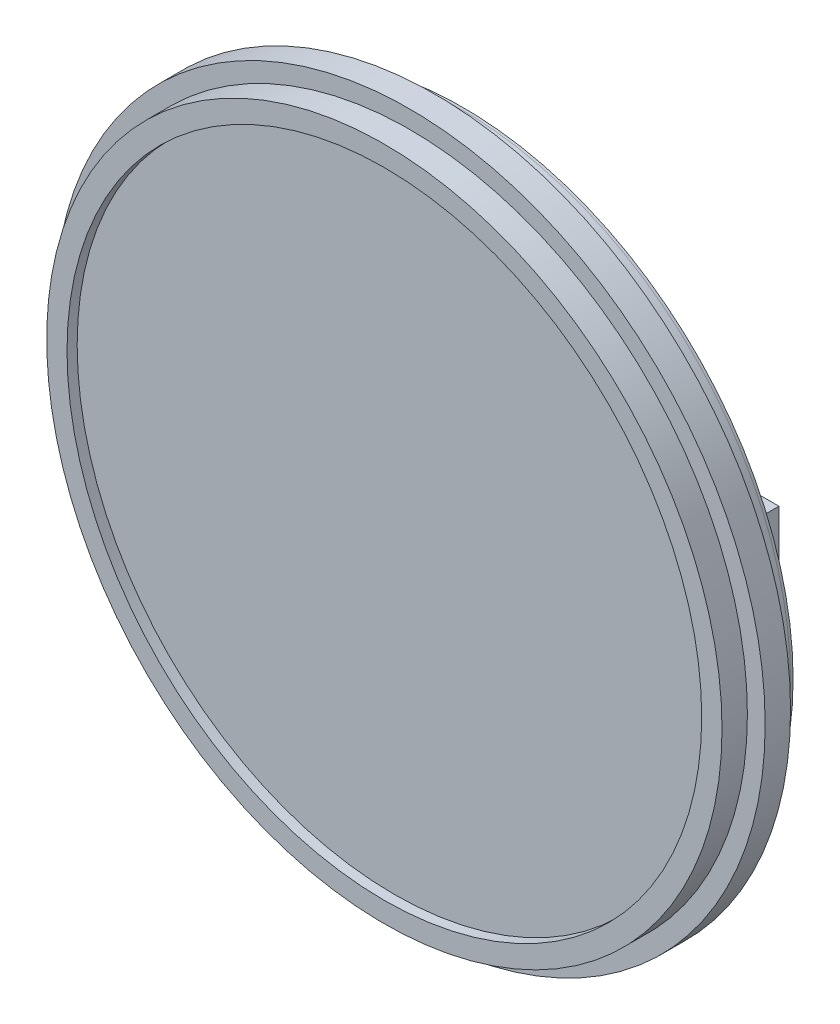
from build123d import *

# Parameters (mm, degrees)
SKETCH_1_R          = 14
EXTRUDE_1_DEPTH     = 1
SKETCH_2_R          = 13.3
EXTRUDE_2_DEPTH     = 1
SKETCH_3_R          = 12.5
CUT_EXTRUDE_2_DEPTH = 0.5
SKETCH_4_R          = 13
EXTRUDE_3_DEPTH     = 1
SKETCH_5_R          = 7.9
EXTRUDE_4_DEPTH     = 2
SKETCH_6_W          = 5.925942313
SKETCH_6_H          = 10.255153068
EXTRUDE_5_DEPTH     = 0.6
SKETCH_7_W          = 4.90352896
SKETCH_7_H          = 1.567823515
CUT_EXTRUDE_3_DEPTH = 0.6
SKETCH_8_R          = 12.5
EXTRUDE_6_DEPTH     = 0.1
SKETCH_9_R          = 13
EXTRUDE_7_DEPTH     = 0.1
EXTRUDE_9_DEPTH     = 0.1
EXTRUDE_9_2_DEPTH   = 0.1
EXTRUDE_9_3_DEPTH   = 0.1
EXTRUDE_9_4_DEPTH   = 0.1
EXTRUDE_9_5_DEPTH   = 0.1
EXTRUDE_9_6_DEPTH   = 0.1
EXTRUDE_9_7_DEPTH   = 0.1
EXTRUDE_9_8_DEPTH   = 0.1


with BuildPart() as part:
    # Sketch 1 → Extrude 1 (new body)
    with BuildSketch(Plane.XY):
        Circle(SKETCH_1_R)
    extrude(amount=EXTRUDE_1_DEPTH)

    # Sketch 4 → Extrude 3 (add)
    with BuildSketch(Plane(origin=(0, 0, 0), x_dir=(-1, 0, 0), z_dir=(0, 0, -1))):
        Circle(SKETCH_4_R)
    extrude(amount=EXTRUDE_3_DEPTH)

    # Sketch 5 → Extrude 4 (add)
    with BuildSketch(Plane(origin=(0, 0, -1), x_dir=(-1, 0, 0), z_dir=(0, 0, -1))):
        Circle(SKETCH_5_R)
    extrude(amount=EXTRUDE_4_DEPTH)


with BuildPart() as body_2:
    # Sketch 2 → Extrude 2 (new body)
    with BuildSketch(Plane.XY.offset(1)):
        Circle(SKETCH_2_R)
    extrude(amount=EXTRUDE_2_DEPTH)

    # Sketch 3 → Cut-Extrude 2 (cut)
    with BuildSketch(Plane.XY.offset(2)):
        Circle(SKETCH_3_R)
    extrude(amount=-CUT_EXTRUDE_2_DEPTH, mode=Mode.SUBTRACT)


with BuildPart() as body_3:
    # Sketch 6 → Extrude 5 (new body)
    with BuildSketch(Plane(origin=(0, 0, -1), x_dir=(-1, 0, 0), z_dir=(0, 0, -1))):
        with Locations((-8.979626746, -0.00802035)):
            Rectangle(SKETCH_6_W, SKETCH_6_H)
    extrude(amount=EXTRUDE_5_DEPTH)


with BuildPart() as cut_extrude_3_tool:
    # Sketch 7 → Cut-Extrude 3 (new body)
    with BuildSketch(Plane(origin=(0, 0, -1.6), x_dir=(-1, 0, 0), z_dir=(0, 0, -1))):
        with Locations((-9.490833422, -0.069704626)):
            Rectangle(SKETCH_7_W, SKETCH_7_H)
    extrude(amount=-CUT_EXTRUDE_3_DEPTH)


with BuildPart() as part_1:
    add(part.part)

    # Cut-Extrude 3: cut by cut_extrude_3_tool
    add(cut_extrude_3_tool.part, mode=Mode.SUBTRACT)


with BuildPart() as body_3_1:
    add(body_3.part)

    # Cut-Extrude 3: cut by cut_extrude_3_tool
    add(cut_extrude_3_tool.part, mode=Mode.SUBTRACT)


with BuildPart() as body_4:
    # Sketch 8 → Extrude 6 (new body)
    with BuildSketch(Plane.XY.offset(1.5)):
        Circle(SKETCH_8_R)
    extrude(amount=EXTRUDE_6_DEPTH)


with BuildPart() as body_5:
    # Sketch 9 → Extrude 7 (new body)
    with BuildSketch(Plane(origin=(0, 0, -1), x_dir=(-1, 0, 0), z_dir=(0, 0, -1))):
        Circle(SKETCH_9_R)
    extrude(amount=EXTRUDE_7_DEPTH)


with BuildPart() as body_6:
    # Sketch 10 → Extrude 9 (new body)
    with BuildSketch(Plane(origin=(0, 0, -3), x_dir=(-1, 0, 0), z_dir=(0, 0, -1))):
        with BuildLine():
            add(Edge.make_bspline(
                [(-4.168273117, 2.779709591), (-4.14661618, 2.768417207), (-4.104377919, 2.746393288), (-4.044221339, 2.710930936), (-3.989244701, 2.673555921), (-3.937922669, 2.636033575), (-3.891156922, 2.59692691), (-3.849470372, 2.556080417), (-3.811833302, 2.514513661), (-3.779004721, 2.47152277), (-3.750129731, 2.427221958), (-3.725174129, 2.381494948), (-3.703843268, 2.334441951), (-3.686937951, 2.285549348), (-3.673011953, 2.23553534), (-3.6634298, 2.183754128), (-3.658276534, 2.130546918), (-3.657302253, 2.094587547), (-3.656808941, 2.076380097)],
                knots=[0, 0, 0, 0, 1.272397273, 2.481599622, 3.635517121, 4.734568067, 5.792894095, 6.808321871, 7.773003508, 8.711915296, 9.623354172, 10.525449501, 11.423591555, 12.311487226, 13.218079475, 14.126165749, 15.051214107, 16, 16, 16, 16], degree=3))
            add(Edge.make_bspline(
                [(-3.656808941, 2.076380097), (-3.657392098, 2.050906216), (-3.658546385, 2.000483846), (-3.66860054, 1.926063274), (-3.683653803, 1.85378532), (-3.70563653, 1.78366583), (-3.734146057, 1.71609172), (-3.769280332, 1.651005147), (-3.809051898, 1.58733936), (-3.840992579, 1.54816636), (-3.857154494, 1.528344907)],
                knots=[0, 0, 0, 0, 1.025265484, 2.029385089, 3.018602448, 3.995076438, 4.983346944, 5.966715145, 6.97116228, 8, 8, 8, 8], degree=3))
            add(Edge.make_bspline(
                [(-3.857154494, 1.528344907), (-3.878197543, 1.505217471), (-3.920023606, 1.45924839), (-3.991674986, 1.399565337), (-4.070310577, 1.349408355), (-4.155626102, 1.308532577), (-4.247393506, 1.276717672), (-4.345593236, 1.253855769), (-4.450416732, 1.240760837), (-4.52246313, 1.23886794), (-4.559423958, 1.237896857)],
                knots=[0, 0, 0, 0, 0.954267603, 1.896743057, 2.838368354, 3.796610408, 4.779680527, 5.799409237, 6.871065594, 8, 8, 8, 8], degree=3))
            add(Edge.make_bspline(
                [(-4.559423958, 1.237896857), (-4.594963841, 1.238768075), (-4.664120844, 1.240463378), (-4.764781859, 1.251949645), (-4.858612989, 1.272079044), (-4.94615981, 1.299629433), (-5.026894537, 1.335469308), (-5.100587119, 1.380076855), (-5.168300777, 1.431656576), (-5.227980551, 1.491689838), (-5.280964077, 1.555989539), (-5.327506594, 1.622325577), (-5.36619176, 1.690704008), (-5.398944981, 1.76010525), (-5.424018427, 1.831502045), (-5.441384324, 1.904527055), (-5.45241315, 1.979052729), (-5.453880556, 2.02934749), (-5.45461877, 2.054649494)],
                knots=[0, 0, 0, 0, 1.256902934, 2.445805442, 3.576955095, 4.645999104, 5.686449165, 6.692658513, 7.68621702, 8.689161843, 9.678783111, 10.630372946, 11.551080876, 12.453998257, 13.34127905, 14.221779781, 15.105423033, 16, 16, 16, 16], degree=3))
            add(Edge.make_bspline(
                [(-5.45461877, 2.054649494), (-5.45418192, 2.073215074), (-5.453318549, 2.109907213), (-5.44734286, 2.16411605), (-5.437735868, 2.216878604), (-5.424688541, 2.268389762), (-5.407006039, 2.318274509), (-5.385656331, 2.366769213), (-5.360761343, 2.413928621), (-5.331973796, 2.460010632), (-5.298483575, 2.504369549), (-5.260562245, 2.547758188), (-5.217451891, 2.58950329), (-5.169632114, 2.630114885), (-5.117649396, 2.670313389), (-5.060153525, 2.70792635), (-4.998668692, 2.745616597), (-4.954970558, 2.768150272), (-4.9325543, 2.779709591)],
                knots=[0, 0, 0, 0, 0.941657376, 1.861047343, 2.762797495, 3.66048619, 4.553285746, 5.444104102, 6.34607688, 7.256116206, 8.197091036, 9.162375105, 10.176350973, 11.237807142, 12.343728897, 13.50695164, 14.721116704, 16, 16, 16, 16], degree=3))
            add(Edge.make_bspline(
                [(-4.9325543, 2.779709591), (-4.963239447, 2.796442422), (-5.022654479, 2.828841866), (-5.10132602, 2.888370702), (-5.168901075, 2.952844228), (-5.223522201, 3.023623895), (-5.266514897, 3.098498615), (-5.296011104, 3.176999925), (-5.315965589, 3.257672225), (-5.317942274, 3.312785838), (-5.318935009, 3.340465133)],
                knots=[0, 0, 0, 0, 1.166880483, 2.259407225, 3.286803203, 4.280235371, 5.237608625, 6.161067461, 7.076446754, 8, 8, 8, 8], degree=3))
            add(Edge.make_bspline(
                [(-5.318935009, 3.340465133), (-5.317698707, 3.368660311), (-5.315213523, 3.425337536), (-5.295117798, 3.509706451), (-5.262369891, 3.592571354), (-5.217828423, 3.673530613), (-5.162351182, 3.749844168), (-5.095792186, 3.818288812), (-5.019740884, 3.878244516), (-4.934576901, 3.928572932), (-4.84292808, 3.969533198), (-4.746229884, 3.997789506), (-4.646167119, 4.016262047), (-4.578057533, 4.018353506), (-4.543523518, 4.019413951)],
                knots=[0, 0, 0, 0, 0.888701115, 1.786444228, 2.72001202, 3.692817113, 4.693886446, 5.687152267, 6.695133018, 7.739871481, 8.800368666, 9.853104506, 10.91144658, 12, 12, 12, 12], degree=3))
            add(Edge.make_bspline(
                [(-4.543523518, 4.019413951), (-4.509880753, 4.018320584), (-4.443541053, 4.01616459), (-4.346027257, 3.998182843), (-4.252723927, 3.968149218), (-4.163952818, 3.927405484), (-4.081303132, 3.877220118), (-4.008276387, 3.816440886), (-3.943769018, 3.748298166), (-3.890410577, 3.672007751), (-3.846442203, 3.591359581), (-3.81582545, 3.506978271), (-3.796206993, 3.420687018), (-3.793732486, 3.362298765), (-3.792492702, 3.333044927)],
                knots=[0, 0, 0, 0, 1.072916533, 2.115669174, 3.151510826, 4.193348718, 5.225979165, 6.227137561, 7.216255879, 8.211077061, 9.189680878, 10.138522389, 11.067357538, 12, 12, 12, 12], degree=3))
            add(Edge.make_bspline(
                [(-3.792492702, 3.333044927), (-3.793577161, 3.304336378), (-3.795706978, 3.247954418), (-3.813623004, 3.165762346), (-3.843795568, 3.088789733), (-3.88499056, 3.016163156), (-3.938682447, 2.949199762), (-4.004154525, 2.887048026), (-4.080884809, 2.829197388), (-4.138534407, 2.796550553), (-4.168273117, 2.779709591)],
                knots=[0, 0, 0, 0, 0.975232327, 1.915300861, 2.843280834, 3.77672583, 4.742871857, 5.749627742, 6.839139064, 8, 8, 8, 8], degree=3))
        make_face()
        with BuildLine():
            add(Edge.make_bspline(
                [(-4.556773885, 3.74804643), (-4.575333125, 3.747553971), (-4.611643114, 3.746590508), (-4.664883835, 3.741556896), (-4.715511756, 3.731764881), (-4.764055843, 3.718733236), (-4.809850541, 3.701128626), (-4.853517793, 3.680419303), (-4.894314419, 3.655241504), (-4.932732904, 3.626998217), (-4.967318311, 3.595933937), (-4.998013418, 3.563568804), (-5.023510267, 3.529267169), (-5.045161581, 3.493882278), (-5.060871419, 3.456363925), (-5.072637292, 3.417862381), (-5.080590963, 3.377891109), (-5.081186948, 3.350573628), (-5.081488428, 3.33675503)],
                knots=[0, 0, 0, 0, 1.203892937, 2.355340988, 3.463153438, 4.544400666, 5.610487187, 6.640501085, 7.674077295, 8.714426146, 9.728707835, 10.68524104, 11.601827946, 12.495867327, 13.368432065, 14.231010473, 15.105153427, 16, 16, 16, 16], degree=3))
            add(Edge.make_bspline(
                [(-5.081488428, 3.33675503), (-5.080968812, 3.322935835), (-5.079941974, 3.295627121), (-5.072000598, 3.255300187), (-5.060164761, 3.215671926), (-5.041530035, 3.17768463), (-5.019179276, 3.140020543), (-4.991593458, 3.103620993), (-4.958717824, 3.068359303), (-4.921655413, 3.034535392), (-4.881278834, 3.002861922), (-4.838503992, 2.975365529), (-4.793867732, 2.952358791), (-4.747828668, 2.933210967), (-4.699917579, 2.918326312), (-4.650428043, 2.907766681), (-4.599351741, 2.901203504), (-4.564743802, 2.900419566), (-4.54723362, 2.900022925)],
                knots=[0, 0, 0, 0, 0.873023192, 1.725219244, 2.590779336, 3.480155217, 4.391973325, 5.357036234, 6.360879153, 7.436073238, 8.526419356, 9.601555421, 10.645666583, 11.697338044, 12.750135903, 13.812665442, 14.89329948, 16, 16, 16, 16], degree=3))
            add(Edge.make_bspline(
                [(-4.54723362, 2.900022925), (-4.524743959, 2.900682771), (-4.479986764, 2.901995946), (-4.414007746, 2.914205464), (-4.349855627, 2.933411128), (-4.288216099, 2.959688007), (-4.230684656, 2.992668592), (-4.179400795, 3.032154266), (-4.134801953, 3.077233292), (-4.097351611, 3.127203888), (-4.068315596, 3.180386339), (-4.045711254, 3.233756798), (-4.032511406, 3.287884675), (-4.030789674, 3.324145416), (-4.029939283, 3.342055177)],
                knots=[0, 0, 0, 0, 1.076279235, 2.141928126, 3.20205304, 4.278698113, 5.344010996, 6.36967002, 7.368914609, 8.37248503, 9.349703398, 10.264243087, 11.142681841, 12, 12, 12, 12], degree=3))
            add(Edge.make_bspline(
                [(-4.029939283, 3.342055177), (-4.030341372, 3.35462518), (-4.031139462, 3.379574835), (-4.03771629, 3.416418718), (-4.048583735, 3.452424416), (-4.063296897, 3.48788937), (-4.082656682, 3.522315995), (-4.105610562, 3.556245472), (-4.133493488, 3.588914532), (-4.164787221, 3.6210845), (-4.200275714, 3.650856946), (-4.239890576, 3.677039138), (-4.283428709, 3.699273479), (-4.330891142, 3.71733224), (-4.382103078, 3.730895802), (-4.436828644, 3.741053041), (-4.495524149, 3.746777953), (-4.535914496, 3.747614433), (-4.556773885, 3.74804643)],
                knots=[0, 0, 0, 0, 0.814439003, 1.616544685, 2.417341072, 3.248991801, 4.09997495, 4.973547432, 5.9003056, 6.880240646, 7.880314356, 8.896779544, 9.951930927, 11.043077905, 12.18215768, 13.381699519, 14.647792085, 16, 16, 16, 16], degree=3))
        make_face(mode=Mode.SUBTRACT)
        with BuildLine():
            add(Edge.make_bspline(
                [(-4.541403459, 2.628655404), (-4.564933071, 2.628236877), (-4.611092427, 2.62741583), (-4.678717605, 2.618276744), (-4.74361851, 2.605554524), (-4.805576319, 2.586254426), (-4.864564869, 2.56115946), (-4.920903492, 2.53097085), (-4.974161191, 2.495285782), (-5.023602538, 2.454557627), (-5.068750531, 2.410667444), (-5.10836115, 2.364204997), (-5.141999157, 2.316033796), (-5.169087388, 2.265542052), (-5.191321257, 2.213798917), (-5.205921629, 2.159515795), (-5.215281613, 2.103736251), (-5.216538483, 2.065817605), (-5.217172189, 2.046699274)],
                knots=[0, 0, 0, 0, 1.140299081, 2.23698856, 3.303958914, 4.344563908, 5.37730929, 6.408454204, 7.439741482, 8.480804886, 9.510774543, 10.48932336, 11.43758569, 12.353841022, 13.263987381, 14.161954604, 15.073269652, 16, 16, 16, 16], degree=3))
            add(Edge.make_bspline(
                [(-5.217172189, 2.046699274), (-5.21614163, 2.022939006), (-5.214097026, 1.975799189), (-5.197876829, 1.906128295), (-5.171845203, 1.838681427), (-5.135540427, 1.774008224), (-5.090585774, 1.713569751), (-5.035305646, 1.660888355), (-4.973135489, 1.614078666), (-4.901971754, 1.576220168), (-4.824238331, 1.545985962), (-4.739955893, 1.525154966), (-4.65033402, 1.511365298), (-4.588452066, 1.509975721), (-4.556773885, 1.509264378)],
                knots=[0, 0, 0, 0, 0.898778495, 1.783155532, 2.693654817, 3.627872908, 4.583023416, 5.533784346, 6.509005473, 7.520592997, 8.575161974, 9.658835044, 10.801527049, 12, 12, 12, 12], degree=3))
            add(Edge.make_bspline(
                [(-4.556773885, 1.509264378), (-4.532016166, 1.509739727), (-4.483780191, 1.51066586), (-4.413411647, 1.518840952), (-4.347005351, 1.531805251), (-4.284690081, 1.550661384), (-4.225768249, 1.573680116), (-4.171238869, 1.603292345), (-4.119699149, 1.636971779), (-4.07368877, 1.676930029), (-4.031783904, 1.719625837), (-3.995246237, 1.764824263), (-3.963528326, 1.811296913), (-3.938634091, 1.860094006), (-3.918732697, 1.910279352), (-3.904427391, 1.962315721), (-3.895600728, 2.016362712), (-3.894708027, 2.053025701), (-3.894255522, 2.071609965)],
                knots=[0, 0, 0, 0, 1.224942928, 2.386581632, 3.501229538, 4.569074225, 5.605009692, 6.626002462, 7.634866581, 8.645888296, 9.63523824, 10.59253846, 11.518950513, 12.414518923, 13.29783783, 14.186679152, 15.080837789, 16, 16, 16, 16], degree=3))
            add(Edge.make_bspline(
                [(-3.894255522, 2.071609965), (-3.894940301, 2.089660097), (-3.896290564, 2.125251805), (-3.904860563, 2.177991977), (-3.919916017, 2.228945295), (-3.940574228, 2.278724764), (-3.968076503, 2.326321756), (-4.000465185, 2.372976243), (-4.039543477, 2.417393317), (-4.083700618, 2.459917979), (-4.131823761, 2.499239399), (-4.1829769, 2.534024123), (-4.236766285, 2.563318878), (-4.293078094, 2.587143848), (-4.351787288, 2.605881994), (-4.412850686, 2.618972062), (-4.476339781, 2.627211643), (-4.519470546, 2.628168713), (-4.541403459, 2.628655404)],
                knots=[0, 0, 0, 0, 0.917430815, 1.809013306, 2.70690318, 3.612392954, 4.541220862, 5.495268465, 6.494511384, 7.542276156, 8.608045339, 9.649016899, 10.681629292, 11.715607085, 12.752076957, 13.808767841, 14.885711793, 16, 16, 16, 16], degree=3))
        make_face(mode=Mode.SUBTRACT)
    extrude(amount=EXTRUDE_9_DEPTH)


with BuildPart() as body_7:
    # Sketch 10 → Extrude 9 2 (new body)
    with BuildSketch(Plane(origin=(0, 0, -3), x_dir=(-1, 0, 0), z_dir=(0, 0, -1))):
        with BuildLine():
            Line((-1.57067112, 1.543185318), (-0.739608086, 1.543185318))
            Line((-0.739608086, 1.543185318), (-0.739608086, 1.305738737))
            Line((-0.739608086, 1.305738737), (-1.799637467, 1.305738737))
            Line((-1.799637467, 1.305738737), (-1.799637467, 1.638587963))
            add(Edge.make_bspline(
                [(-1.799637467, 1.638587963), (-1.753212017, 1.667164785), (-1.664097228, 1.722018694), (-1.538130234, 1.804409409), (-1.42617257, 1.884526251), (-1.327285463, 1.961188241), (-1.241627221, 2.034748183), (-1.168948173, 2.105157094), (-1.1096607, 2.172611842), (-1.063391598, 2.23840586), (-1.026990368, 2.303057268), (-0.99564101, 2.36712496), (-0.968934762, 2.43205634), (-0.947235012, 2.497787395), (-0.930162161, 2.564356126), (-0.917849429, 2.631631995), (-0.911002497, 2.699888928), (-0.909811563, 2.745597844), (-0.909212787, 2.768579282)],
                knots=[0, 0, 0, 0, 1.726964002, 3.314949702, 4.76710701, 6.087048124, 7.277484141, 8.342115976, 9.29034651, 10.117945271, 10.885025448, 11.63844732, 12.376368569, 13.107316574, 13.829469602, 14.551817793, 15.271885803, 16, 16, 16, 16], degree=3))
            add(Edge.make_bspline(
                [(-0.909212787, 2.768579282), (-0.910149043, 2.80501337), (-0.911978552, 2.876208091), (-0.925678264, 2.980203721), (-0.949795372, 3.078316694), (-0.982632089, 3.170926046), (-1.024523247, 3.258220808), (-1.077011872, 3.33899492), (-1.138455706, 3.414394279), (-1.208896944, 3.483411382), (-1.28656499, 3.545867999), (-1.370746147, 3.60027566), (-1.46083765, 3.645674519), (-1.556189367, 3.684023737), (-1.657911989, 3.711831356), (-1.764590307, 3.733528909), (-1.877273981, 3.745566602), (-1.954198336, 3.747206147), (-1.993622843, 3.74804643)],
                knots=[0, 0, 0, 0, 1.062437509, 2.076076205, 3.052086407, 4.003844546, 4.937153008, 5.869009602, 6.806518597, 7.768404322, 8.739669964, 9.708677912, 10.685721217, 11.677931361, 12.700644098, 13.756614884, 14.850242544, 16, 16, 16, 16], degree=3))
            add(Edge.make_bspline(
                [(-1.993622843, 3.74804643), (-2.033048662, 3.747204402), (-2.110151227, 3.745557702), (-2.22299046, 3.733503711), (-2.329996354, 3.712082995), (-2.431471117, 3.683025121), (-2.527629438, 3.646109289), (-2.617405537, 3.599588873), (-2.701813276, 3.545230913), (-2.779881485, 3.48303287), (-2.850545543, 3.41381967), (-2.911690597, 3.337994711), (-2.964251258, 3.257046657), (-3.006671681, 3.170128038), (-3.039846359, 3.077717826), (-3.062792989, 2.979537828), (-3.077600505, 2.875915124), (-3.079290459, 2.804849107), (-3.080152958, 2.768579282)],
                knots=[0, 0, 0, 0, 1.14892738, 2.246884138, 3.302092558, 4.325479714, 5.319883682, 6.298567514, 7.266875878, 8.241460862, 9.202652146, 10.143479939, 11.074663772, 12.009555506, 12.955777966, 13.929873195, 14.943473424, 16, 16, 16, 16], degree=3))
            add(Edge.make_bspline(
                [(-3.080152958, 2.768579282), (-3.079786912, 2.745771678), (-3.079058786, 2.70040359), (-3.071909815, 2.632733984), (-3.060152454, 2.566039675), (-3.044429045, 2.500058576), (-3.023373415, 2.435242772), (-2.998697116, 2.370971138), (-2.96872323, 2.307861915), (-2.933870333, 2.24403199), (-2.888907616, 2.179011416), (-2.830122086, 2.112416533), (-2.758146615, 2.041626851), (-2.671375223, 1.968192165), (-2.571398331, 1.889843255), (-2.456858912, 1.808767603), (-2.328407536, 1.723939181), (-2.237241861, 1.667830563), (-2.189728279, 1.638587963)],
                knots=[0, 0, 0, 0, 0.721480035, 1.435142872, 2.150161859, 2.863342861, 3.579344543, 4.304992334, 5.040202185, 5.788409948, 6.604059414, 7.535407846, 8.59480259, 9.795963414, 11.130050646, 12.612998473, 14.2347679, 16, 16, 16, 16], degree=3))
            Line((-2.189728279, 1.638587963), (-2.189728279, 1.305738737))
            Line((-2.189728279, 1.305738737), (-3.249757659, 1.305738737))
            Line((-3.249757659, 1.305738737), (-3.249757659, 1.543185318))
            Line((-3.249757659, 1.543185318), (-2.418694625, 1.543185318))
            add(Edge.make_bspline(
                [(-2.418694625, 1.543185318), (-2.462349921, 1.569908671), (-2.54683868, 1.621628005), (-2.665908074, 1.701443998), (-2.773316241, 1.780082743), (-2.869687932, 1.856792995), (-2.954574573, 1.932402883), (-3.028302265, 2.006566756), (-3.090174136, 2.079661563), (-3.140985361, 2.152430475), (-3.182467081, 2.225684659), (-3.218757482, 2.299590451), (-3.249784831, 2.375223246), (-3.273817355, 2.453274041), (-3.293898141, 2.532775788), (-3.307254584, 2.614526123), (-3.316261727, 2.697885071), (-3.317151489, 2.754068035), (-3.317599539, 2.782359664)],
                knots=[0, 0, 0, 0, 1.521507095, 2.944665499, 4.259859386, 5.477903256, 6.604940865, 7.637391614, 8.584217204, 9.448190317, 10.271606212, 11.084316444, 11.894783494, 12.698740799, 13.510160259, 14.330421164, 15.159262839, 16, 16, 16, 16], degree=3))
            add(Edge.make_bspline(
                [(-3.317599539, 2.782359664), (-3.316526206, 2.827293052), (-3.31442175, 2.915392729), (-3.296548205, 3.044117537), (-3.267514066, 3.166345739), (-3.2265163, 3.282048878), (-3.173926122, 3.391296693), (-3.109197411, 3.493744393), (-3.032909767, 3.589658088), (-2.945579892, 3.678123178), (-2.849691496, 3.758651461), (-2.745788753, 3.828069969), (-2.636023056, 3.887386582), (-2.519864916, 3.93571934), (-2.397223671, 3.973474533), (-2.268247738, 4.000322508), (-2.132900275, 4.016502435), (-2.040662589, 4.018430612), (-1.993622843, 4.019413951)],
                knots=[0, 0, 0, 0, 1.060031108, 2.07837429, 3.060328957, 4.020369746, 4.969556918, 5.915799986, 6.874309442, 7.856113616, 8.844790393, 9.824263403, 10.799921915, 11.784872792, 12.788496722, 13.823745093, 14.890144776, 16, 16, 16, 16], degree=3))
            add(Edge.make_bspline(
                [(-1.993622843, 4.019413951), (-1.946584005, 4.018426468), (-1.854348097, 4.016490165), (-1.719159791, 4.000389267), (-1.590395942, 3.97338687), (-1.4678996, 3.935741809), (-1.351787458, 3.88733352), (-1.242118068, 3.828397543), (-1.139039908, 3.758286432), (-1.043213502, 3.678176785), (-0.955973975, 3.589620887), (-0.879550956, 3.493911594), (-0.815535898, 3.391125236), (-0.762812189, 3.282072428), (-0.721861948, 3.166339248), (-0.692814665, 3.044119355), (-0.67494476, 2.915392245), (-0.672839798, 2.827292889), (-0.671766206, 2.782359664)],
                knots=[0, 0, 0, 0, 1.110772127, 2.178052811, 3.210072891, 4.214525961, 5.200290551, 6.176755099, 7.150120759, 8.139614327, 9.122229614, 10.081530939, 11.026337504, 11.976308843, 12.937142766, 13.91990867, 14.939093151, 16, 16, 16, 16], degree=3))
            add(Edge.make_bspline(
                [(-0.671766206, 2.782359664), (-0.672219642, 2.754069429), (-0.673120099, 2.697889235), (-0.682048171, 2.61450981), (-0.695693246, 2.532877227), (-0.714685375, 2.45308157), (-0.739788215, 2.375341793), (-0.770546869, 2.299571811), (-0.806915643, 2.225690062), (-0.848374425, 2.152427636), (-0.899198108, 2.079667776), (-0.961041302, 2.006541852), (-1.034790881, 1.932601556), (-1.119189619, 1.8564267), (-1.216051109, 1.780301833), (-1.323423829, 1.70140281), (-1.442536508, 1.621639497), (-1.527019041, 1.569912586), (-1.57067112, 1.543185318)],
                knots=[0, 0, 0, 0, 0.840708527, 1.669521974, 2.489754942, 3.299905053, 4.10542877, 4.915868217, 5.728550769, 6.551938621, 7.415882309, 8.362675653, 9.395091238, 10.51818009, 11.740285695, 13.055434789, 14.478544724, 16, 16, 16, 16], degree=3))
        make_face()
    extrude(amount=EXTRUDE_9_2_DEPTH)


with BuildPart() as body_8:
    # Sketch 10 → Extrude 9 3 (new body)
    with BuildSketch(Plane(origin=(0, 0, -3), x_dir=(-1, 0, 0), z_dir=(0, 0, -1))):
        Polygon((1.213496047, 3.951572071), (1.702699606, 3.951572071), (1.702699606, 1.305738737), (1.465253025, 1.305738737), (1.465253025, 3.680204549), (1.058201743, 3.680204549), align=None)
    extrude(amount=EXTRUDE_9_3_DEPTH)


with BuildPart() as body_9:
    # Sketch 10 → Extrude 9 4 (new body)
    with BuildSketch(Plane(origin=(0, 0, -3), x_dir=(-1, 0, 0), z_dir=(0, 0, -1))):
        Polygon((2.754248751, 3.951572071), (2.999645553, 3.951572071), (3.517469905, 2.01118829), (4.28758125, 3.951572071), (4.322032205, 3.951572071), (5.077833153, 2.024438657), (5.598307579, 3.951572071), (5.841054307, 3.951572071), (5.127654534, 1.305738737), (5.093733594, 1.305738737), (4.297651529, 3.329334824), (3.4920292, 1.305738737), (3.45810826, 1.305738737), align=None)
    extrude(amount=EXTRUDE_9_4_DEPTH)


with BuildPart() as body_10:
    # Sketch 10 → Extrude 9 5 (new body)
    with BuildSketch(Plane(origin=(0, 0, -3), x_dir=(-1, 0, 0), z_dir=(0, 0, -1))):
        with BuildLine():
            Line((-5.115409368, -2.272252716), (-5.35285595, -2.272252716))
            add(Edge.make_bspline(
                [(-5.35285595, -2.272252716), (-5.351308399, -2.240751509), (-5.348269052, -2.178883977), (-5.334035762, -2.088680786), (-5.313669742, -2.002460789), (-5.284874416, -1.920916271), (-5.249113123, -1.84332622), (-5.206227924, -1.769998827), (-5.155432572, -1.701213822), (-5.09782391, -1.637608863), (-5.035254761, -1.579258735), (-4.967743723, -1.528870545), (-4.896801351, -1.486297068), (-4.822642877, -1.450705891), (-4.744431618, -1.42399065), (-4.662877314, -1.404168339), (-4.577621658, -1.392242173), (-4.51953426, -1.39096024), (-4.489992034, -1.390308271)],
                knots=[0, 0, 0, 0, 1.10065271, 2.161652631, 3.183658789, 4.190468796, 5.17591951, 6.163126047, 7.15150782, 8.156236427, 9.156009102, 10.134482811, 11.092018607, 12.041330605, 13.001268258, 13.972401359, 14.968799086, 16, 16, 16, 16], degree=3))
            add(Edge.make_bspline(
                [(-4.489992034, -1.390308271), (-4.460980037, -1.390987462), (-4.403972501, -1.392322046), (-4.320770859, -1.403783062), (-4.241564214, -1.421733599), (-4.16650739, -1.446918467), (-4.096199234, -1.480773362), (-4.030111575, -1.521441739), (-3.967457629, -1.568476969), (-3.911058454, -1.623853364), (-3.859269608, -1.682970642), (-3.814591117, -1.746083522), (-3.776329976, -1.811268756), (-3.744438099, -1.879023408), (-3.720961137, -1.949985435), (-3.703137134, -2.023121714), (-3.693062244, -2.099189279), (-3.691516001, -2.150674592), (-3.690729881, -2.176850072)],
                knots=[0, 0, 0, 0, 1.111607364, 2.184268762, 3.212621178, 4.221274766, 5.211760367, 6.196651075, 7.1921475, 8.207485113, 9.220403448, 10.201281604, 11.166441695, 12.114753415, 13.065576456, 14.026450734, 14.996634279, 16, 16, 16, 16], degree=3))
            add(Edge.make_bspline(
                [(-3.690729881, -2.176850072), (-3.692009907, -2.213701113), (-3.694547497, -2.286756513), (-3.716254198, -2.394112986), (-3.750156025, -2.498127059), (-3.790975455, -2.581839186), (-3.832154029, -2.649295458), (-3.869261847, -2.704834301), (-3.912702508, -2.764634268), (-3.963108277, -2.828495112), (-4.019436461, -2.896917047), (-4.082197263, -2.969858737), (-4.151838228, -3.046566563), (-4.200716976, -3.098958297), (-4.226044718, -3.126106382)],
                knots=[0, 0, 0, 0, 1.184426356, 2.348067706, 3.509069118, 4.696110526, 5.333549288, 6.050745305, 6.844228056, 7.710549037, 8.667450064, 9.695053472, 10.805634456, 12, 12, 12, 12], degree=3))
            Line((-4.226044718, -3.126106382), (-4.888033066, -3.832615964))
            Line((-4.888033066, -3.832615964), (-3.656808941, -3.832615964))
            Line((-3.656808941, -3.832615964), (-3.656808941, -4.103983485))
            Line((-3.656808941, -4.103983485), (-5.45461877, -4.103983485))
            Line((-5.45461877, -4.103983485), (-4.42851033, -3.008973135))
            add(Edge.make_bspline(
                [(-4.42851033, -3.008973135), (-4.403527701, -2.982894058), (-4.355541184, -2.932801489), (-4.287669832, -2.859668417), (-4.226710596, -2.791822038), (-4.172268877, -2.72939054), (-4.125525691, -2.671460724), (-4.084044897, -2.619908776), (-4.050809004, -2.5724694), (-4.014738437, -2.517480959), (-3.979802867, -2.450343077), (-3.949782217, -2.368296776), (-3.931476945, -2.283836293), (-3.929281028, -2.226760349), (-3.928176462, -2.198050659)],
                knots=[0, 0, 0, 0, 1.329631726, 2.553950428, 3.673215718, 4.687767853, 5.603093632, 6.413772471, 7.123043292, 7.734684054, 8.834405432, 9.900288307, 10.943827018, 12, 12, 12, 12], degree=3))
            add(Edge.make_bspline(
                [(-3.928176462, -2.198050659), (-3.928657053, -2.179997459), (-3.929604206, -2.144418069), (-3.937963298, -2.092253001), (-3.950595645, -2.041933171), (-3.96869712, -1.993303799), (-3.992590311, -1.946853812), (-4.021674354, -1.902526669), (-4.055231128, -1.859672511), (-4.094050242, -1.819491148), (-4.136694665, -1.782690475), (-4.18174508, -1.75009072), (-4.229407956, -1.722846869), (-4.279482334, -1.700513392), (-4.331828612, -1.682993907), (-4.386548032, -1.670854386), (-4.443489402, -1.663232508), (-4.482370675, -1.662201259), (-4.502182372, -1.661675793)],
                knots=[0, 0, 0, 0, 0.991446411, 1.95395049, 2.89581595, 3.838931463, 4.798493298, 5.75982156, 6.748411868, 7.785213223, 8.824556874, 9.840280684, 10.836137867, 11.835679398, 12.848801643, 13.863922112, 14.911575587, 16, 16, 16, 16], degree=3))
            add(Edge.make_bspline(
                [(-4.502182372, -1.661675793), (-4.522873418, -1.662216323), (-4.563507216, -1.663277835), (-4.623166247, -1.670703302), (-4.68007871, -1.68351355), (-4.734387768, -1.701034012), (-4.786185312, -1.723303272), (-4.83521944, -1.751040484), (-4.881380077, -1.78413872), (-4.924753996, -1.821664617), (-4.964716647, -1.863444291), (-4.999828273, -1.91001849), (-5.030507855, -1.960536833), (-5.05727555, -2.014863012), (-5.079013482, -2.073489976), (-5.095624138, -2.13620961), (-5.108767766, -2.202749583), (-5.113158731, -2.248700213), (-5.115409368, -2.272252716)],
                knots=[0, 0, 0, 0, 1.031018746, 2.02475058, 2.990194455, 3.934040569, 4.864654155, 5.795059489, 6.735614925, 7.690564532, 8.649604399, 9.611025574, 10.590972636, 11.591080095, 12.624614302, 13.701020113, 14.821632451, 16, 16, 16, 16], degree=3))
        make_face()
    extrude(amount=EXTRUDE_9_5_DEPTH)


with BuildPart() as body_11:
    # Sketch 10 → Extrude 9 6 (new body)
    with BuildSketch(Plane(origin=(0, 0, -3), x_dir=(-1, 0, 0), z_dir=(0, 0, -1))):
        with BuildLine():
            add(Edge.make_bspline(
                [(-2.133016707, -2.630012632), (-2.111359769, -2.641305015), (-2.069121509, -2.663328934), (-2.008964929, -2.698791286), (-1.953988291, -2.736166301), (-1.902666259, -2.773688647), (-1.855900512, -2.812795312), (-1.814213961, -2.853641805), (-1.776576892, -2.895208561), (-1.743748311, -2.938199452), (-1.714873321, -2.982500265), (-1.689917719, -3.028227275), (-1.668586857, -3.075280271), (-1.651681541, -3.124172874), (-1.637755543, -3.174186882), (-1.628173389, -3.225968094), (-1.623020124, -3.279175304), (-1.622045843, -3.315134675), (-1.621552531, -3.333342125)],
                knots=[0, 0, 0, 0, 1.272397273, 2.481599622, 3.635517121, 4.734568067, 5.792894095, 6.808321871, 7.773003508, 8.711915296, 9.623354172, 10.525449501, 11.423591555, 12.311487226, 13.218079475, 14.126165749, 15.051214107, 16, 16, 16, 16], degree=3))
            add(Edge.make_bspline(
                [(-1.621552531, -3.333342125), (-1.622135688, -3.358816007), (-1.623289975, -3.409238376), (-1.633344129, -3.483658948), (-1.648397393, -3.555936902), (-1.670380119, -3.626056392), (-1.698889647, -3.693630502), (-1.734023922, -3.758717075), (-1.773795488, -3.822382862), (-1.805736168, -3.861555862), (-1.821898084, -3.881377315)],
                knots=[0, 0, 0, 0, 1.025265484, 2.029385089, 3.018602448, 3.995076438, 4.983346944, 5.966715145, 6.97116228, 8, 8, 8, 8], degree=3))
            add(Edge.make_bspline(
                [(-1.821898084, -3.881377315), (-1.842941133, -3.904504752), (-1.884767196, -3.950473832), (-1.956418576, -4.010156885), (-2.035054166, -4.060313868), (-2.120369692, -4.101189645), (-2.212137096, -4.13300455), (-2.310336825, -4.155866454), (-2.415160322, -4.168961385), (-2.48720672, -4.170854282), (-2.524167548, -4.171825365)],
                knots=[0, 0, 0, 0, 0.954267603, 1.896743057, 2.838368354, 3.796610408, 4.779680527, 5.799409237, 6.871065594, 8, 8, 8, 8], degree=3))
            add(Edge.make_bspline(
                [(-2.524167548, -4.171825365), (-2.559707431, -4.170954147), (-2.628864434, -4.169258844), (-2.729525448, -4.157772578), (-2.823356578, -4.137643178), (-2.9109034, -4.110092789), (-2.991638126, -4.074252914), (-3.065330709, -4.029645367), (-3.133044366, -3.978065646), (-3.192724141, -3.918032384), (-3.245707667, -3.853732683), (-3.292250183, -3.787396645), (-3.33093535, -3.719018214), (-3.363688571, -3.649616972), (-3.388762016, -3.578220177), (-3.406127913, -3.505195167), (-3.41715674, -3.430669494), (-3.418624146, -3.380374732), (-3.41936236, -3.355072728)],
                knots=[0, 0, 0, 0, 1.256902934, 2.445805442, 3.576955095, 4.645999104, 5.686449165, 6.692658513, 7.68621702, 8.689161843, 9.678783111, 10.630372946, 11.551080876, 12.453998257, 13.34127905, 14.221779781, 15.105423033, 16, 16, 16, 16], degree=3))
            add(Edge.make_bspline(
                [(-3.41936236, -3.355072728), (-3.418925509, -3.336507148), (-3.418062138, -3.29981501), (-3.41208645, -3.245606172), (-3.402479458, -3.192843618), (-3.389432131, -3.141332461), (-3.371749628, -3.091447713), (-3.350399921, -3.04295301), (-3.325504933, -2.995793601), (-3.296717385, -2.94971159), (-3.263227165, -2.905352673), (-3.225305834, -2.861964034), (-3.182195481, -2.820218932), (-3.134375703, -2.779607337), (-3.082392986, -2.739408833), (-3.024897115, -2.701795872), (-2.963412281, -2.664105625), (-2.919714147, -2.64157195), (-2.89729789, -2.630012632)],
                knots=[0, 0, 0, 0, 0.941657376, 1.861047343, 2.762797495, 3.66048619, 4.553285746, 5.444104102, 6.34607688, 7.256116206, 8.197091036, 9.162375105, 10.176350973, 11.237807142, 12.343728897, 13.50695164, 14.721116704, 16, 16, 16, 16], degree=3))
            add(Edge.make_bspline(
                [(-2.89729789, -2.630012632), (-2.927983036, -2.613279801), (-2.987398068, -2.580880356), (-3.06606961, -2.521351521), (-3.133644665, -2.456877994), (-3.188265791, -2.386098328), (-3.231258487, -2.311223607), (-3.260754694, -2.232722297), (-3.280709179, -2.152049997), (-3.282685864, -2.096936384), (-3.283678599, -2.069257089)],
                knots=[0, 0, 0, 0, 1.166880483, 2.259407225, 3.286803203, 4.280235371, 5.237608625, 6.161067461, 7.076446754, 8, 8, 8, 8], degree=3))
            add(Edge.make_bspline(
                [(-3.283678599, -2.069257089), (-3.282442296, -2.041061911), (-3.279957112, -1.984384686), (-3.259861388, -1.900015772), (-3.22711348, -1.817150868), (-3.182572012, -1.736191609), (-3.127094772, -1.659878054), (-3.060535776, -1.59143341), (-2.984484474, -1.531477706), (-2.899320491, -1.48114929), (-2.80767167, -1.440189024), (-2.710973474, -1.411932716), (-2.610910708, -1.393460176), (-2.542801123, -1.391368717), (-2.508267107, -1.390308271)],
                knots=[0, 0, 0, 0, 0.888701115, 1.786444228, 2.72001202, 3.692817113, 4.693886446, 5.687152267, 6.695133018, 7.739871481, 8.800368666, 9.853104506, 10.91144658, 12, 12, 12, 12], degree=3))
            add(Edge.make_bspline(
                [(-2.508267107, -1.390308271), (-2.474624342, -1.391401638), (-2.408284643, -1.393557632), (-2.310770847, -1.411539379), (-2.217467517, -1.441573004), (-2.128696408, -1.482316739), (-2.046046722, -1.532502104), (-1.973019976, -1.593281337), (-1.908512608, -1.661424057), (-1.855154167, -1.737714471), (-1.811185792, -1.818362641), (-1.78056904, -1.902743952), (-1.760950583, -1.989035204), (-1.758476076, -2.047423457), (-1.757236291, -2.076677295)],
                knots=[0, 0, 0, 0, 1.072916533, 2.115669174, 3.151510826, 4.193348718, 5.225979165, 6.227137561, 7.216255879, 8.211077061, 9.189680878, 10.138522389, 11.067357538, 12, 12, 12, 12], degree=3))
            add(Edge.make_bspline(
                [(-1.757236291, -2.076677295), (-1.758320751, -2.105385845), (-1.760450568, -2.161767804), (-1.778366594, -2.243959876), (-1.808539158, -2.320932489), (-1.84973415, -2.393559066), (-1.903426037, -2.46052246), (-1.968898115, -2.522674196), (-2.045628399, -2.580524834), (-2.103277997, -2.613171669), (-2.133016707, -2.630012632)],
                knots=[0, 0, 0, 0, 0.975232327, 1.915300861, 2.843280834, 3.77672583, 4.742871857, 5.749627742, 6.839139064, 8, 8, 8, 8], degree=3))
        make_face()
        with BuildLine():
            add(Edge.make_bspline(
                [(-2.521517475, -1.661675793), (-2.540076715, -1.662168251), (-2.576386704, -1.663131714), (-2.629627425, -1.668165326), (-2.680255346, -1.677957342), (-2.728799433, -1.690988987), (-2.77459413, -1.708593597), (-2.818261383, -1.729302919), (-2.859058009, -1.754480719), (-2.897476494, -1.782724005), (-2.932061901, -1.813788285), (-2.962757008, -1.846153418), (-2.988253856, -1.880455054), (-3.009905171, -1.915839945), (-3.025615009, -1.953358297), (-3.037380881, -1.991859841), (-3.045334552, -2.031831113), (-3.045930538, -2.059148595), (-3.046232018, -2.072967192)],
                knots=[0, 0, 0, 0, 1.203892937, 2.355340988, 3.463153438, 4.544400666, 5.610487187, 6.640501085, 7.674077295, 8.714426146, 9.728707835, 10.68524104, 11.601827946, 12.495867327, 13.368432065, 14.231010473, 15.105153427, 16, 16, 16, 16], degree=3))
            add(Edge.make_bspline(
                [(-3.046232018, -2.072967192), (-3.045712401, -2.086786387), (-3.044685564, -2.114095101), (-3.036744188, -2.154422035), (-3.024908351, -2.194050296), (-3.006273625, -2.232037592), (-2.983922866, -2.269701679), (-2.956337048, -2.306101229), (-2.923461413, -2.341362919), (-2.886399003, -2.37518683), (-2.846022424, -2.4068603), (-2.803247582, -2.434356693), (-2.758611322, -2.457363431), (-2.712572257, -2.476511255), (-2.664661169, -2.49139591), (-2.615171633, -2.501955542), (-2.56409533, -2.508518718), (-2.529487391, -2.509302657), (-2.51197721, -2.509699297)],
                knots=[0, 0, 0, 0, 0.873023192, 1.725219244, 2.590779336, 3.480155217, 4.391973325, 5.357036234, 6.360879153, 7.436073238, 8.526419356, 9.601555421, 10.645666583, 11.697338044, 12.750135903, 13.812665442, 14.89329948, 16, 16, 16, 16], degree=3))
            add(Edge.make_bspline(
                [(-2.51197721, -2.509699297), (-2.489487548, -2.509039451), (-2.444730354, -2.507726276), (-2.378751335, -2.495516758), (-2.314599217, -2.476311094), (-2.252959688, -2.450034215), (-2.195428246, -2.41705363), (-2.144144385, -2.377567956), (-2.099545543, -2.33248893), (-2.062095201, -2.282518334), (-2.033059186, -2.229335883), (-2.010454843, -2.175965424), (-1.997254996, -2.121837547), (-1.995533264, -2.085576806), (-1.994682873, -2.067667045)],
                knots=[0, 0, 0, 0, 1.076279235, 2.141928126, 3.20205304, 4.278698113, 5.344010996, 6.36967002, 7.368914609, 8.37248503, 9.349703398, 10.264243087, 11.142681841, 12, 12, 12, 12], degree=3))
            add(Edge.make_bspline(
                [(-1.994682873, -2.067667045), (-1.995084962, -2.055097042), (-1.995883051, -2.030147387), (-2.002459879, -1.993303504), (-2.013327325, -1.957297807), (-2.028040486, -1.921832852), (-2.047400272, -1.887406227), (-2.070354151, -1.85347675), (-2.098237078, -1.82080769), (-2.12953081, -1.788637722), (-2.165019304, -1.758865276), (-2.204634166, -1.732683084), (-2.248172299, -1.710448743), (-2.295634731, -1.692389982), (-2.346846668, -1.67882642), (-2.401572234, -1.668669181), (-2.460267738, -1.662944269), (-2.500658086, -1.662107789), (-2.521517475, -1.661675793)],
                knots=[0, 0, 0, 0, 0.814439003, 1.616544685, 2.417341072, 3.248991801, 4.09997495, 4.973547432, 5.9003056, 6.880240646, 7.880314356, 8.896779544, 9.951930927, 11.043077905, 12.18215768, 13.381699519, 14.647792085, 16, 16, 16, 16], degree=3))
        make_face(mode=Mode.SUBTRACT)
        with BuildLine():
            add(Edge.make_bspline(
                [(-2.506147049, -2.781066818), (-2.52967666, -2.781485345), (-2.575836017, -2.782306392), (-2.643461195, -2.791445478), (-2.7083621, -2.804167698), (-2.770319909, -2.823467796), (-2.829308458, -2.848562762), (-2.885647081, -2.878751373), (-2.938904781, -2.91443644), (-2.988346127, -2.955164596), (-3.03349412, -2.999054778), (-3.07310474, -3.045517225), (-3.106742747, -3.093688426), (-3.133830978, -3.144180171), (-3.156064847, -3.195923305), (-3.170665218, -3.250206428), (-3.180025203, -3.305985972), (-3.181282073, -3.343904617), (-3.181915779, -3.363022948)],
                knots=[0, 0, 0, 0, 1.140299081, 2.23698856, 3.303958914, 4.344563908, 5.37730929, 6.408454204, 7.439741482, 8.480804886, 9.510774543, 10.48932336, 11.43758569, 12.353841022, 13.263987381, 14.161954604, 15.073269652, 16, 16, 16, 16], degree=3))
            add(Edge.make_bspline(
                [(-3.181915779, -3.363022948), (-3.18088522, -3.386783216), (-3.178840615, -3.433923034), (-3.162620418, -3.503593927), (-3.136588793, -3.571040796), (-3.100284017, -3.635713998), (-3.055329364, -3.696152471), (-3.000049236, -3.748833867), (-2.937879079, -3.795643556), (-2.866715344, -3.833502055), (-2.78898192, -3.863736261), (-2.704699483, -3.884567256), (-2.615077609, -3.898356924), (-2.553195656, -3.899746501), (-2.521517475, -3.900457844)],
                knots=[0, 0, 0, 0, 0.898778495, 1.783155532, 2.693654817, 3.627872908, 4.583023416, 5.533784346, 6.509005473, 7.520592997, 8.575161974, 9.658835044, 10.801527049, 12, 12, 12, 12], degree=3))
            add(Edge.make_bspline(
                [(-2.521517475, -3.900457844), (-2.496759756, -3.899982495), (-2.448523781, -3.899056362), (-2.378155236, -3.890881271), (-2.311748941, -3.877916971), (-2.24943367, -3.859060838), (-2.190511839, -3.836042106), (-2.135982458, -3.806429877), (-2.084442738, -3.772750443), (-2.03843236, -3.732792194), (-1.996527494, -3.690096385), (-1.959989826, -3.64489796), (-1.928271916, -3.598425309), (-1.903377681, -3.549628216), (-1.883476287, -3.49944287), (-1.869170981, -3.447406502), (-1.860344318, -3.39335951), (-1.859451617, -3.356696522), (-1.858999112, -3.338112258)],
                knots=[0, 0, 0, 0, 1.224942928, 2.386581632, 3.501229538, 4.569074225, 5.605009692, 6.626002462, 7.634866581, 8.645888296, 9.63523824, 10.59253846, 11.518950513, 12.414518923, 13.29783783, 14.186679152, 15.080837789, 16, 16, 16, 16], degree=3))
            add(Edge.make_bspline(
                [(-1.858999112, -3.338112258), (-1.85968389, -3.320062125), (-1.861034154, -3.284470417), (-1.869604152, -3.231730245), (-1.884659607, -3.180776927), (-1.905317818, -3.130997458), (-1.932820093, -3.083400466), (-1.965208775, -3.036745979), (-2.004287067, -2.992328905), (-2.048444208, -2.949804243), (-2.096567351, -2.910482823), (-2.14772049, -2.875698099), (-2.201509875, -2.846403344), (-2.257821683, -2.822578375), (-2.316530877, -2.803840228), (-2.377594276, -2.79075016), (-2.441083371, -2.782510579), (-2.484214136, -2.781553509), (-2.506147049, -2.781066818)],
                knots=[0, 0, 0, 0, 0.917430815, 1.809013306, 2.70690318, 3.612392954, 4.541220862, 5.495268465, 6.494511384, 7.542276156, 8.608045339, 9.649016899, 10.681629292, 11.715607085, 12.752076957, 13.808767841, 14.885711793, 16, 16, 16, 16], degree=3))
        make_face(mode=Mode.SUBTRACT)
    extrude(amount=EXTRUDE_9_6_DEPTH)


with BuildPart() as body_12:
    # Sketch 10 → Extrude 9 7 (new body)
    with BuildSketch(Plane(origin=(0, 0, -3), x_dir=(-1, 0, 0), z_dir=(0, 0, -1))):
        with BuildLine():
            Line((-1.214501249, -2.170489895), (-0.977054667, -2.170489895))
            Line((-0.977054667, -2.170489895), (-0.977054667, -2.506519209))
            add(Edge.make_bspline(
                [(-0.977054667, -2.506519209), (-0.955673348, -2.477122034), (-0.914704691, -2.420794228), (-0.847526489, -2.346567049), (-0.780415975, -2.283574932), (-0.732085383, -2.250507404), (-0.708867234, -2.234621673)],
                knots=[0, 0, 0, 0, 1.134379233, 2.173579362, 3.122582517, 4, 4, 4, 4], degree=3))
            add(Edge.make_bspline(
                [(-0.708867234, -2.234621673), (-0.677219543, -2.219498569), (-0.614477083, -2.189516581), (-0.515130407, -2.159101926), (-0.413473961, -2.140410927), (-0.344827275, -2.137854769), (-0.310296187, -2.136568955)],
                knots=[0, 0, 0, 0, 1.014936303, 2.012140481, 3.000054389, 4, 4, 4, 4], degree=3))
            add(Edge.make_bspline(
                [(-0.310296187, -2.136568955), (-0.286942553, -2.137359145), (-0.240726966, -2.138922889), (-0.172249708, -2.149098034), (-0.105832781, -2.166686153), (-0.041868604, -2.191184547), (0.018396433, -2.220853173), (0.073648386, -2.25566456), (0.123257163, -2.294745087), (0.16719769, -2.339859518), (0.206710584, -2.392274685), (0.243055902, -2.453404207), (0.276639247, -2.524620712), (0.295251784, -2.576302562), (0.305050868, -2.603511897)],
                knots=[0, 0, 0, 0, 1.009824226, 1.998387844, 2.986035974, 3.974953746, 4.955485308, 5.885931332, 6.793869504, 7.679848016, 8.601185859, 9.625726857, 10.749998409, 12, 12, 12, 12], degree=3))
            add(Edge.make_bspline(
                [(0.305050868, -2.603511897), (0.315415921, -2.584821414), (0.33581289, -2.548041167), (0.370061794, -2.495987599), (0.405945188, -2.447299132), (0.443768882, -2.401937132), (0.483399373, -2.36012561), (0.52502317, -2.321726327), (0.568403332, -2.28657438), (0.628722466, -2.245508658), (0.707199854, -2.201889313), (0.806145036, -2.164070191), (0.909068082, -2.14069907), (0.978931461, -2.137954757), (1.014210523, -2.136568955)],
                knots=[0, 0, 0, 0, 0.86119277, 1.694706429, 2.50939023, 3.298075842, 4.073795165, 4.829715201, 5.57930267, 6.321991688, 7.768977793, 9.186738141, 10.579381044, 12, 12, 12, 12], degree=3))
            add(Edge.make_bspline(
                [(1.014210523, -2.136568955), (1.046626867, -2.137791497), (1.1100688, -2.14018413), (1.202428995, -2.158972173), (1.288563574, -2.191234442), (1.368299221, -2.235256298), (1.440235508, -2.290576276), (1.502765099, -2.356396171), (1.555508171, -2.432250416), (1.589963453, -2.503606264), (1.61333392, -2.566603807), (1.627743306, -2.620281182), (1.640473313, -2.679360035), (1.651042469, -2.743911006), (1.658767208, -2.814162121), (1.664490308, -2.889998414), (1.668363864, -2.971478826), (1.668637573, -3.027695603), (1.668778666, -3.056674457)],
                knots=[0, 0, 0, 0, 1.209669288, 2.367440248, 3.500751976, 4.631527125, 5.755587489, 6.87532382, 8.007944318, 9.190864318, 9.82315674, 10.514484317, 11.263564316, 12.079023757, 12.955305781, 13.901327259, 14.918167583, 16, 16, 16, 16], degree=3))
            Line((1.668778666, -3.056674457), (1.668778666, -4.103983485))
            Line((1.668778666, -4.103983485), (1.431332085, -4.103983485))
            Line((1.431332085, -4.103983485), (1.431332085, -3.055614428))
            add(Edge.make_bspline(
                [(1.431332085, -3.055614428), (1.431273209, -3.030879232), (1.431160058, -2.983341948), (1.429123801, -2.915115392), (1.425287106, -2.852924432), (1.420800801, -2.796853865), (1.414568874, -2.746772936), (1.406521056, -2.702782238), (1.397995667, -2.664535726), (1.38383215, -2.622137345), (1.36119297, -2.575366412), (1.326708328, -2.524926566), (1.283263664, -2.481020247), (1.233098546, -2.4429064), (1.175987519, -2.41191716), (1.113043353, -2.38978589), (1.044656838, -2.376085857), (0.997316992, -2.374720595), (0.972869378, -2.374015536)],
                knots=[0, 0, 0, 0, 1.253487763, 2.409012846, 3.458416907, 4.410876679, 5.259312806, 6.014470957, 6.676830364, 7.243083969, 8.276244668, 9.299465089, 10.325150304, 11.392391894, 12.482080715, 13.603491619, 14.762376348, 16, 16, 16, 16], degree=3))
            add(Edge.make_bspline(
                [(0.972869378, -2.374015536), (0.942880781, -2.375086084), (0.883611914, -2.377201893), (0.797096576, -2.39880238), (0.713963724, -2.431368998), (0.636693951, -2.478564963), (0.565613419, -2.535116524), (0.50445719, -2.602358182), (0.453935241, -2.678429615), (0.41972539, -2.748844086), (0.398113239, -2.812094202), (0.38384319, -2.867352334), (0.372743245, -2.930158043), (0.362333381, -3.000089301), (0.355539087, -3.077627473), (0.349364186, -3.162413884), (0.346475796, -3.254703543), (0.34607177, -3.31867729), (0.345861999, -3.35189264)],
                knots=[0, 0, 0, 0, 1.090531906, 2.155305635, 3.229839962, 4.33261226, 5.44038871, 6.529323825, 7.629011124, 8.757537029, 9.370236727, 10.061839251, 10.834451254, 11.692844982, 12.636905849, 13.66920014, 14.789842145, 16, 16, 16, 16], degree=3))
            Line((0.345861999, -3.35189264), (0.345861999, -4.103983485))
            Line((0.345861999, -4.103983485), (0.108415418, -4.103983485))
            Line((0.108415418, -4.103983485), (0.108415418, -3.120806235))
            add(Edge.make_bspline(
                [(0.108415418, -3.120806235), (0.108355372, -3.093067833), (0.108239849, -3.039701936), (0.106216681, -2.963174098), (0.102371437, -2.893565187), (0.097926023, -2.830956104), (0.091530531, -2.775460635), (0.084266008, -2.726781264), (0.075686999, -2.68504003), (0.061482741, -2.639256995), (0.03977597, -2.588819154), (0.004859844, -2.53503993), (-0.038688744, -2.487968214), (-0.089769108, -2.447782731), (-0.147225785, -2.414565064), (-0.210713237, -2.390631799), (-0.279659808, -2.376703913), (-0.327192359, -2.374928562), (-0.351637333, -2.374015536)],
                knots=[0, 0, 0, 0, 1.320475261, 2.540461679, 3.643808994, 4.639130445, 5.527981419, 6.302341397, 6.981980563, 7.553956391, 8.582137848, 9.585246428, 10.591171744, 11.620968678, 12.668337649, 13.738356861, 14.836885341, 16, 16, 16, 16], degree=3))
            add(Edge.make_bspline(
                [(-0.351637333, -2.374015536), (-0.380375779, -2.375172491), (-0.43765048, -2.377478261), (-0.521789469, -2.398232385), (-0.603043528, -2.430741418), (-0.680116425, -2.4758414), (-0.75092962, -2.531705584), (-0.812923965, -2.597409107), (-0.865041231, -2.672134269), (-0.899612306, -2.741806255), (-0.921911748, -2.803471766), (-0.936724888, -2.85589778), (-0.949454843, -2.914106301), (-0.958914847, -2.978276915), (-0.968047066, -3.04799167), (-0.972454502, -3.123597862), (-0.976741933, -3.205030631), (-0.976947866, -3.261252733), (-0.977054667, -3.290410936)],
                knots=[0, 0, 0, 0, 1.098833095, 2.189935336, 3.297829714, 4.440610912, 5.596351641, 6.740013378, 7.886572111, 9.072425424, 9.705826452, 10.395263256, 11.156850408, 11.985370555, 12.878090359, 13.847760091, 14.883794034, 16, 16, 16, 16], degree=3))
            Line((-0.977054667, -3.290410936), (-0.977054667, -4.103983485))
            Line((-0.977054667, -4.103983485), (-1.214501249, -4.103983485))
            Line((-1.214501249, -4.103983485), (-1.214501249, -2.170489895))
        make_face()
    extrude(amount=EXTRUDE_9_7_DEPTH)


with BuildPart() as body_13:
    # Sketch 10 → Extrude 9 8 (new body)
    with BuildSketch(Plane(origin=(0, 0, -3), x_dir=(-1, 0, 0), z_dir=(0, 0, -1))):
        with BuildLine():
            Line((2.211513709, -2.170489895), (2.44896029, -2.170489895))
            Line((2.44896029, -2.170489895), (2.44896029, -2.506519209))
            add(Edge.make_bspline(
                [(2.44896029, -2.506519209), (2.470341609, -2.477122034), (2.511310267, -2.420794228), (2.578488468, -2.346567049), (2.645598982, -2.283574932), (2.693929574, -2.250507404), (2.717147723, -2.234621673)],
                knots=[0, 0, 0, 0, 1.134379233, 2.173579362, 3.122582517, 4, 4, 4, 4], degree=3))
            add(Edge.make_bspline(
                [(2.717147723, -2.234621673), (2.748795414, -2.219498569), (2.811537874, -2.189516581), (2.91088455, -2.159101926), (3.012540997, -2.140410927), (3.081187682, -2.137854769), (3.11571877, -2.136568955)],
                knots=[0, 0, 0, 0, 1.014936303, 2.012140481, 3.000054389, 4, 4, 4, 4], degree=3))
            add(Edge.make_bspline(
                [(3.11571877, -2.136568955), (3.139072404, -2.137359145), (3.185287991, -2.138922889), (3.253765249, -2.149098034), (3.320182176, -2.166686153), (3.384146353, -2.191184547), (3.44441139, -2.220853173), (3.499663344, -2.25566456), (3.54927212, -2.294745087), (3.593212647, -2.339859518), (3.632725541, -2.392274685), (3.66907086, -2.453404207), (3.702654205, -2.524620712), (3.721266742, -2.576302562), (3.731065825, -2.603511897)],
                knots=[0, 0, 0, 0, 1.009824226, 1.998387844, 2.986035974, 3.974953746, 4.955485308, 5.885931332, 6.793869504, 7.679848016, 8.601185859, 9.625726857, 10.749998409, 12, 12, 12, 12], degree=3))
            add(Edge.make_bspline(
                [(3.731065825, -2.603511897), (3.741430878, -2.584821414), (3.761827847, -2.548041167), (3.796076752, -2.495987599), (3.831960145, -2.447299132), (3.869783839, -2.401937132), (3.909414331, -2.36012561), (3.951038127, -2.321726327), (3.994418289, -2.28657438), (4.054737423, -2.245508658), (4.133214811, -2.201889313), (4.232159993, -2.164070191), (4.335083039, -2.14069907), (4.404946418, -2.137954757), (4.440225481, -2.136568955)],
                knots=[0, 0, 0, 0, 0.86119277, 1.694706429, 2.50939023, 3.298075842, 4.073795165, 4.829715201, 5.57930267, 6.321991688, 7.768977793, 9.186738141, 10.579381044, 12, 12, 12, 12], degree=3))
            add(Edge.make_bspline(
                [(4.440225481, -2.136568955), (4.472641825, -2.137791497), (4.536083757, -2.14018413), (4.628443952, -2.158972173), (4.714578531, -2.191234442), (4.794314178, -2.235256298), (4.866250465, -2.290576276), (4.928780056, -2.356396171), (4.981523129, -2.432250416), (5.01597841, -2.503606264), (5.039348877, -2.566603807), (5.053758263, -2.620281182), (5.06648827, -2.679360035), (5.077057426, -2.743911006), (5.084782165, -2.814162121), (5.090505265, -2.889998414), (5.094378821, -2.971478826), (5.09465253, -3.027695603), (5.094793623, -3.056674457)],
                knots=[0, 0, 0, 0, 1.209669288, 2.367440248, 3.500751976, 4.631527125, 5.755587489, 6.87532382, 8.007944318, 9.190864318, 9.82315674, 10.514484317, 11.263564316, 12.079023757, 12.955305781, 13.901327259, 14.918167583, 16, 16, 16, 16], degree=3))
            Line((5.094793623, -3.056674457), (5.094793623, -4.103983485))
            Line((5.094793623, -4.103983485), (4.857347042, -4.103983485))
            Line((4.857347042, -4.103983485), (4.857347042, -3.055614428))
            add(Edge.make_bspline(
                [(4.857347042, -3.055614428), (4.857288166, -3.030879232), (4.857175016, -2.983341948), (4.855138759, -2.915115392), (4.851302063, -2.852924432), (4.846815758, -2.796853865), (4.840583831, -2.746772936), (4.832536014, -2.702782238), (4.824010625, -2.664535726), (4.809847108, -2.622137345), (4.787207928, -2.575366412), (4.752723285, -2.524926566), (4.709278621, -2.481020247), (4.659113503, -2.4429064), (4.602002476, -2.41191716), (4.539058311, -2.38978589), (4.470671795, -2.376085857), (4.423331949, -2.374720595), (4.398884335, -2.374015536)],
                knots=[0, 0, 0, 0, 1.253487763, 2.409012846, 3.458416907, 4.410876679, 5.259312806, 6.014470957, 6.676830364, 7.243083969, 8.276244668, 9.299465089, 10.325150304, 11.392391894, 12.482080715, 13.603491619, 14.762376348, 16, 16, 16, 16], degree=3))
            add(Edge.make_bspline(
                [(4.398884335, -2.374015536), (4.368895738, -2.375086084), (4.309626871, -2.377201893), (4.223111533, -2.39880238), (4.139978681, -2.431368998), (4.062708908, -2.478564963), (3.991628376, -2.535116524), (3.930472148, -2.602358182), (3.879950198, -2.678429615), (3.845740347, -2.748844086), (3.824128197, -2.812094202), (3.809858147, -2.867352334), (3.798758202, -2.930158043), (3.788348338, -3.000089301), (3.781554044, -3.077627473), (3.775379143, -3.162413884), (3.772490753, -3.254703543), (3.772086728, -3.31867729), (3.771876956, -3.35189264)],
                knots=[0, 0, 0, 0, 1.090531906, 2.155305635, 3.229839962, 4.33261226, 5.44038871, 6.529323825, 7.629011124, 8.757537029, 9.370236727, 10.061839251, 10.834451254, 11.692844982, 12.636905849, 13.66920014, 14.789842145, 16, 16, 16, 16], degree=3))
            Line((3.771876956, -3.35189264), (3.771876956, -4.103983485))
            Line((3.771876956, -4.103983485), (3.534430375, -4.103983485))
            Line((3.534430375, -4.103983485), (3.534430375, -3.120806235))
            add(Edge.make_bspline(
                [(3.534430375, -3.120806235), (3.534370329, -3.093067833), (3.534254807, -3.039701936), (3.532231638, -2.963174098), (3.528386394, -2.893565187), (3.52394098, -2.830956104), (3.517545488, -2.775460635), (3.510280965, -2.726781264), (3.501701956, -2.68504003), (3.487497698, -2.639256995), (3.465790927, -2.588819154), (3.430874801, -2.53503993), (3.387326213, -2.487968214), (3.336245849, -2.447782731), (3.278789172, -2.414565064), (3.215301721, -2.390631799), (3.14635515, -2.376703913), (3.098822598, -2.374928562), (3.074377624, -2.374015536)],
                knots=[0, 0, 0, 0, 1.320475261, 2.540461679, 3.643808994, 4.639130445, 5.527981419, 6.302341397, 6.981980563, 7.553956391, 8.582137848, 9.585246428, 10.591171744, 11.620968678, 12.668337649, 13.738356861, 14.836885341, 16, 16, 16, 16], degree=3))
            add(Edge.make_bspline(
                [(3.074377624, -2.374015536), (3.045639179, -2.375172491), (2.988364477, -2.377478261), (2.904225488, -2.398232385), (2.82297143, -2.430741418), (2.745898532, -2.4758414), (2.675085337, -2.531705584), (2.613090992, -2.597409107), (2.560973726, -2.672134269), (2.526402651, -2.741806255), (2.50410321, -2.803471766), (2.48929007, -2.85589778), (2.476560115, -2.914106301), (2.46710011, -2.978276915), (2.457967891, -3.04799167), (2.453560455, -3.123597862), (2.449273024, -3.205030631), (2.449067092, -3.261252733), (2.44896029, -3.290410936)],
                knots=[0, 0, 0, 0, 1.098833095, 2.189935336, 3.297829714, 4.440610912, 5.596351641, 6.740013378, 7.886572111, 9.072425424, 9.705826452, 10.395263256, 11.156850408, 11.985370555, 12.878090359, 13.847760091, 14.883794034, 16, 16, 16, 16], degree=3))
            Line((2.44896029, -3.290410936), (2.44896029, -4.103983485))
            Line((2.44896029, -4.103983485), (2.211513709, -4.103983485))
            Line((2.211513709, -4.103983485), (2.211513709, -2.170489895))
        make_face()
    extrude(amount=EXTRUDE_9_8_DEPTH)


solid = Compound([body_2.part, part_1.part, body_3_1.part, body_4.part, body_5.part, body_6.part, body_7.part, body_8.part, body_9.part, body_10.part, body_11.part, body_12.part, body_13.part])
